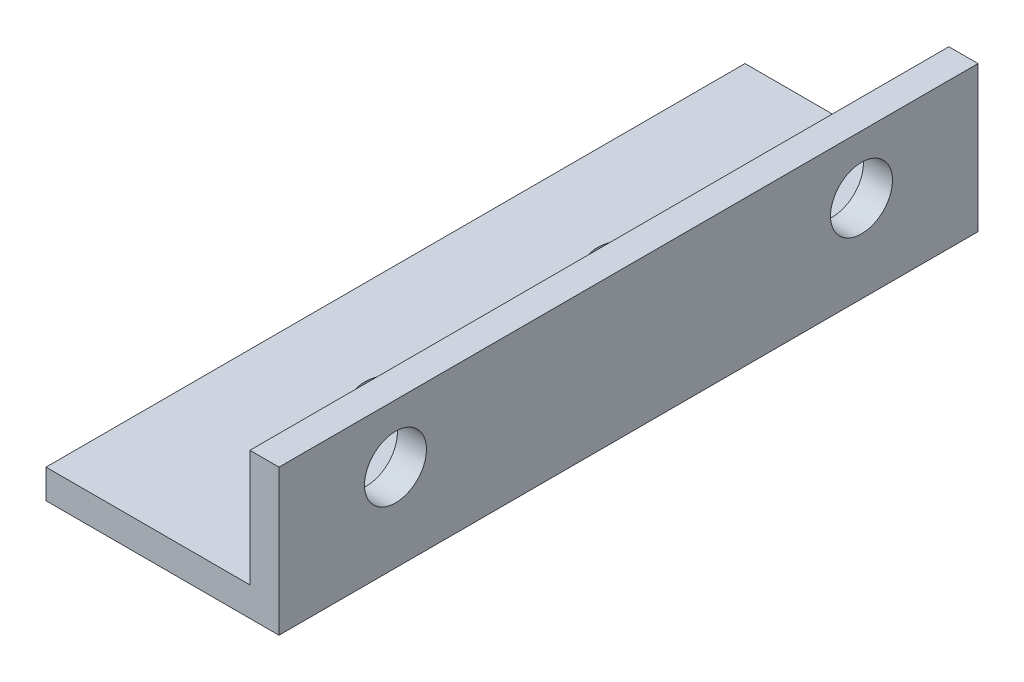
ISO-10303-21;
HEADER;
FILE_DESCRIPTION(('STEP AP214'),'2;1');
FILE_NAME('part.step','',(''),(''),'','','');
FILE_SCHEMA(('AUTOMOTIVE_DESIGN { 1 0 10303 214 1 1 1 1 }'));
ENDSEC;
DATA;
#1=APPLICATION_CONTEXT('core data for automotive mechanical design processes');
#2=APPLICATION_PROTOCOL_DEFINITION('international standard','automotive_design',2000,#1);
#3=PRODUCT_CONTEXT('',#1,'mechanical');
#4=PRODUCT('Part','Part','',(#3));
#5=PRODUCT_RELATED_PRODUCT_CATEGORY('part','',(#4));
#6=PRODUCT_DEFINITION_FORMATION('','',#4);
#7=PRODUCT_DEFINITION_CONTEXT('part definition',#1,'design');
#8=PRODUCT_DEFINITION('design','',#6,#7);
#9=PRODUCT_DEFINITION_SHAPE('','',#8);
#10=(LENGTH_UNIT() NAMED_UNIT(*) SI_UNIT(.MILLI.,.METRE.));
#11=(NAMED_UNIT(*) PLANE_ANGLE_UNIT() SI_UNIT($,.RADIAN.));
#12=(NAMED_UNIT(*) SI_UNIT($,.STERADIAN.) SOLID_ANGLE_UNIT());
#13=UNCERTAINTY_MEASURE_WITH_UNIT(LENGTH_MEASURE(1.E-05),#10,'distance_accuracy_value','');
#14=(GEOMETRIC_REPRESENTATION_CONTEXT(3) GLOBAL_UNCERTAINTY_ASSIGNED_CONTEXT((#13)) GLOBAL_UNIT_ASSIGNED_CONTEXT((#10,
#11,#12)) REPRESENTATION_CONTEXT('',''));
#15=CARTESIAN_POINT('',(0.,0.,0.));
#16=DIRECTION('',(0.,0.,1.));
#17=DIRECTION('',(1.,0.,0.));
#18=AXIS2_PLACEMENT_3D('',#15,#16,#17);
#19=CARTESIAN_POINT('',(-25.4,0.,-76.2));
#20=DIRECTION('',(0.,-1.,0.));
#21=DIRECTION('',(1.,0.,0.));
#22=AXIS2_PLACEMENT_3D('',#19,#20,#21);
#23=PLANE('',#22);
#24=CARTESIAN_POINT('',(-12.7,0.,-50.8));
#25=DIRECTION('',(0.,1.,0.));
#26=DIRECTION('',(0.,0.,1.));
#27=AXIS2_PLACEMENT_3D('',#24,#25,#26);
#28=CIRCLE('',#27,3.3782);
#29=CARTESIAN_POINT('',(-12.7,0.,-47.4218));
#30=VERTEX_POINT('',#29);
#31=EDGE_CURVE('E176',#30,#30,#28,.T.);
#32=ORIENTED_EDGE('',*,*,#31,.T.);
#33=EDGE_LOOP('',(#32));
#34=FACE_BOUND('',#33,.T.);
#35=CARTESIAN_POINT('',(-12.7,0.,-25.4));
#36=DIRECTION('',(0.,1.,0.));
#37=DIRECTION('',(0.,0.,1.));
#38=AXIS2_PLACEMENT_3D('',#35,#36,#37);
#39=CIRCLE('',#38,3.3782);
#40=CARTESIAN_POINT('',(-12.7,0.,-22.0218));
#41=VERTEX_POINT('',#40);
#42=EDGE_CURVE('E121',#41,#41,#39,.T.);
#43=ORIENTED_EDGE('',*,*,#42,.T.);
#44=EDGE_LOOP('',(#43));
#45=FACE_BOUND('',#44,.T.);
#46=DIRECTION('',(1.,0.,0.));
#47=VECTOR('',#46,1.);
#48=CARTESIAN_POINT('',(-25.4,0.,0.));
#49=LINE('',#48,#47);
#50=CARTESIAN_POINT('',(-25.4,0.,0.));
#51=VERTEX_POINT('',#50);
#52=CARTESIAN_POINT('',(0.,0.,0.));
#53=VERTEX_POINT('',#52);
#54=EDGE_CURVE('E117',#51,#53,#49,.T.);
#55=ORIENTED_EDGE('',*,*,#54,.F.);
#56=DIRECTION('',(0.,0.,1.));
#57=VECTOR('',#56,1.);
#58=CARTESIAN_POINT('',(-25.4,0.,-76.2));
#59=LINE('',#58,#57);
#60=CARTESIAN_POINT('',(-25.4,0.,-76.2));
#61=VERTEX_POINT('',#60);
#62=EDGE_CURVE('E11',#61,#51,#59,.T.);
#63=ORIENTED_EDGE('',*,*,#62,.F.);
#64=DIRECTION('',(1.,0.,0.));
#65=VECTOR('',#64,1.);
#66=CARTESIAN_POINT('',(-25.4,0.,-76.2));
#67=LINE('',#66,#65);
#68=CARTESIAN_POINT('',(0.,0.,-76.2));
#69=VERTEX_POINT('',#68);
#70=EDGE_CURVE('E132',#61,#69,#67,.T.);
#71=ORIENTED_EDGE('',*,*,#70,.T.);
#72=DIRECTION('',(0.,0.,1.));
#73=VECTOR('',#72,1.);
#74=CARTESIAN_POINT('',(0.,0.,-76.2));
#75=LINE('',#74,#73);
#76=EDGE_CURVE('E35',#69,#53,#75,.T.);
#77=ORIENTED_EDGE('',*,*,#76,.T.);
#78=EDGE_LOOP('',(#55,#63,#71,#77));
#79=FACE_BOUND('',#78,.T.);
#80=ADVANCED_FACE('F32',(#34,#45,#79),#23,.T.);
#81=CARTESIAN_POINT('',(-25.4,3.175,-76.2));
#82=DIRECTION('',(-1.,0.,0.));
#83=DIRECTION('',(0.,0.,1.));
#84=AXIS2_PLACEMENT_3D('',#81,#82,#83);
#85=PLANE('',#84);
#86=DIRECTION('',(0.,-1.,0.));
#87=VECTOR('',#86,1.);
#88=CARTESIAN_POINT('',(-25.4,3.175,0.));
#89=LINE('',#88,#87);
#90=CARTESIAN_POINT('',(-25.4,3.175,0.));
#91=VERTEX_POINT('',#90);
#92=EDGE_CURVE('E130',#91,#51,#89,.T.);
#93=ORIENTED_EDGE('',*,*,#92,.F.);
#94=DIRECTION('',(0.,0.,1.));
#95=VECTOR('',#94,1.);
#96=CARTESIAN_POINT('',(-25.4,3.175,-76.2));
#97=LINE('',#96,#95);
#98=CARTESIAN_POINT('',(-25.4,3.175,-76.2));
#99=VERTEX_POINT('',#98);
#100=EDGE_CURVE('E41',#99,#91,#97,.T.);
#101=ORIENTED_EDGE('',*,*,#100,.F.);
#102=DIRECTION('',(0.,-1.,0.));
#103=VECTOR('',#102,1.);
#104=CARTESIAN_POINT('',(-25.4,3.175,-76.2));
#105=LINE('',#104,#103);
#106=EDGE_CURVE('E107',#99,#61,#105,.T.);
#107=ORIENTED_EDGE('',*,*,#106,.T.);
#108=ORIENTED_EDGE('',*,*,#62,.T.);
#109=EDGE_LOOP('',(#93,#101,#107,#108));
#110=FACE_BOUND('',#109,.T.);
#111=ADVANCED_FACE('F140',(#110),#85,.T.);
#112=CARTESIAN_POINT('',(-3.175,3.175,-76.2));
#113=DIRECTION('',(0.,1.,0.));
#114=DIRECTION('',(0.,0.,1.));
#115=AXIS2_PLACEMENT_3D('',#112,#113,#114);
#116=PLANE('',#115);
#117=CARTESIAN_POINT('',(-12.7,3.175,-50.8));
#118=DIRECTION('',(0.,1.,0.));
#119=DIRECTION('',(0.,0.,1.));
#120=AXIS2_PLACEMENT_3D('',#117,#118,#119);
#121=CIRCLE('',#120,3.37819999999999);
#122=CARTESIAN_POINT('',(-12.7,3.175,-47.4218));
#123=VERTEX_POINT('',#122);
#124=EDGE_CURVE('E172',#123,#123,#121,.T.);
#125=ORIENTED_EDGE('',*,*,#124,.F.);
#126=EDGE_LOOP('',(#125));
#127=FACE_BOUND('',#126,.T.);
#128=CARTESIAN_POINT('',(-12.7,3.175,-25.4));
#129=DIRECTION('',(0.,1.,0.));
#130=DIRECTION('',(0.,0.,1.));
#131=AXIS2_PLACEMENT_3D('',#128,#129,#130);
#132=CIRCLE('',#131,3.37819999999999);
#133=CARTESIAN_POINT('',(-12.7,3.175,-22.0218));
#134=VERTEX_POINT('',#133);
#135=EDGE_CURVE('E184',#134,#134,#132,.T.);
#136=ORIENTED_EDGE('',*,*,#135,.F.);
#137=EDGE_LOOP('',(#136));
#138=FACE_BOUND('',#137,.T.);
#139=DIRECTION('',(-1.,0.,0.));
#140=VECTOR('',#139,1.);
#141=CARTESIAN_POINT('',(-3.175,3.175,0.));
#142=LINE('',#141,#140);
#143=CARTESIAN_POINT('',(-3.175,3.175,0.));
#144=VERTEX_POINT('',#143);
#145=EDGE_CURVE('E94',#144,#91,#142,.T.);
#146=ORIENTED_EDGE('',*,*,#145,.F.);
#147=DIRECTION('',(0.,0.,1.));
#148=VECTOR('',#147,1.);
#149=CARTESIAN_POINT('',(-3.175,3.175,-76.2));
#150=LINE('',#149,#148);
#151=CARTESIAN_POINT('',(-3.175,3.175,-76.2));
#152=VERTEX_POINT('',#151);
#153=EDGE_CURVE('E89',#152,#144,#150,.T.);
#154=ORIENTED_EDGE('',*,*,#153,.F.);
#155=DIRECTION('',(-1.,0.,0.));
#156=VECTOR('',#155,1.);
#157=CARTESIAN_POINT('',(-3.175,3.175,-76.2));
#158=LINE('',#157,#156);
#159=EDGE_CURVE('E92',#152,#99,#158,.T.);
#160=ORIENTED_EDGE('',*,*,#159,.T.);
#161=ORIENTED_EDGE('',*,*,#100,.T.);
#162=EDGE_LOOP('',(#146,#154,#160,#161));
#163=FACE_BOUND('',#162,.T.);
#164=ADVANCED_FACE('F91',(#127,#138,#163),#116,.T.);
#165=CARTESIAN_POINT('',(-3.175,15.875,-76.2));
#166=DIRECTION('',(-1.,0.,0.));
#167=DIRECTION('',(0.,-1.,0.));
#168=AXIS2_PLACEMENT_3D('',#165,#166,#167);
#169=PLANE('',#168);
#170=CARTESIAN_POINT('',(-3.175,9.525,-63.5));
#171=DIRECTION('',(-1.,0.,0.));
#172=DIRECTION('',(0.,0.,1.));
#173=AXIS2_PLACEMENT_3D('',#170,#171,#172);
#174=CIRCLE('',#173,3.37819999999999);
#175=CARTESIAN_POINT('',(-3.175,9.525,-60.1218));
#176=VERTEX_POINT('',#175);
#177=EDGE_CURVE('E217',#176,#176,#174,.T.);
#178=ORIENTED_EDGE('',*,*,#177,.F.);
#179=EDGE_LOOP('',(#178));
#180=FACE_BOUND('',#179,.T.);
#181=CARTESIAN_POINT('',(-3.175,9.525,-12.7));
#182=DIRECTION('',(-1.,0.,0.));
#183=DIRECTION('',(0.,0.,1.));
#184=AXIS2_PLACEMENT_3D('',#181,#182,#183);
#185=CIRCLE('',#184,3.37819999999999);
#186=CARTESIAN_POINT('',(-3.175,9.525,-9.32180000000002));
#187=VERTEX_POINT('',#186);
#188=EDGE_CURVE('E173',#187,#187,#185,.T.);
#189=ORIENTED_EDGE('',*,*,#188,.F.);
#190=EDGE_LOOP('',(#189));
#191=FACE_BOUND('',#190,.T.);
#192=DIRECTION('',(0.,-1.,0.));
#193=VECTOR('',#192,1.);
#194=CARTESIAN_POINT('',(-3.175,15.875,0.));
#195=LINE('',#194,#193);
#196=CARTESIAN_POINT('',(-3.175,15.875,0.));
#197=VERTEX_POINT('',#196);
#198=EDGE_CURVE('E127',#197,#144,#195,.T.);
#199=ORIENTED_EDGE('',*,*,#198,.F.);
#200=DIRECTION('',(0.,0.,1.));
#201=VECTOR('',#200,1.);
#202=CARTESIAN_POINT('',(-3.175,15.875,-76.2));
#203=LINE('',#202,#201);
#204=CARTESIAN_POINT('',(-3.175,15.875,-76.2));
#205=VERTEX_POINT('',#204);
#206=EDGE_CURVE('E99',#205,#197,#203,.T.);
#207=ORIENTED_EDGE('',*,*,#206,.F.);
#208=DIRECTION('',(0.,-1.,0.));
#209=VECTOR('',#208,1.);
#210=CARTESIAN_POINT('',(-3.175,15.875,-76.2));
#211=LINE('',#210,#209);
#212=EDGE_CURVE('E105',#205,#152,#211,.T.);
#213=ORIENTED_EDGE('',*,*,#212,.T.);
#214=ORIENTED_EDGE('',*,*,#153,.T.);
#215=EDGE_LOOP('',(#199,#207,#213,#214));
#216=FACE_BOUND('',#215,.T.);
#217=ADVANCED_FACE('F109',(#180,#191,#216),#169,.T.);
#218=CARTESIAN_POINT('',(0.,15.875,-76.2));
#219=DIRECTION('',(0.,1.,0.));
#220=DIRECTION('',(0.,0.,1.));
#221=AXIS2_PLACEMENT_3D('',#218,#219,#220);
#222=PLANE('',#221);
#223=DIRECTION('',(-1.,0.,0.));
#224=VECTOR('',#223,1.);
#225=CARTESIAN_POINT('',(0.,15.875,0.));
#226=LINE('',#225,#224);
#227=CARTESIAN_POINT('',(0.,15.875,0.));
#228=VERTEX_POINT('',#227);
#229=EDGE_CURVE('E124',#228,#197,#226,.T.);
#230=ORIENTED_EDGE('',*,*,#229,.F.);
#231=DIRECTION('',(0.,0.,1.));
#232=VECTOR('',#231,1.);
#233=CARTESIAN_POINT('',(0.,15.875,-76.2));
#234=LINE('',#233,#232);
#235=CARTESIAN_POINT('',(0.,15.875,-76.2));
#236=VERTEX_POINT('',#235);
#237=EDGE_CURVE('E135',#236,#228,#234,.T.);
#238=ORIENTED_EDGE('',*,*,#237,.F.);
#239=DIRECTION('',(-1.,0.,0.));
#240=VECTOR('',#239,1.);
#241=CARTESIAN_POINT('',(0.,15.875,-76.2));
#242=LINE('',#241,#240);
#243=EDGE_CURVE('E110',#236,#205,#242,.T.);
#244=ORIENTED_EDGE('',*,*,#243,.T.);
#245=ORIENTED_EDGE('',*,*,#206,.T.);
#246=EDGE_LOOP('',(#230,#238,#244,#245));
#247=FACE_BOUND('',#246,.T.);
#248=ADVANCED_FACE('F155',(#247),#222,.T.);
#249=CARTESIAN_POINT('',(0.,0.,-76.2));
#250=DIRECTION('',(1.,0.,0.));
#251=DIRECTION('',(0.,0.,-1.));
#252=AXIS2_PLACEMENT_3D('',#249,#250,#251);
#253=PLANE('',#252);
#254=CARTESIAN_POINT('',(0.,9.525,-63.5));
#255=DIRECTION('',(-1.,0.,0.));
#256=DIRECTION('',(0.,0.,1.));
#257=AXIS2_PLACEMENT_3D('',#254,#255,#256);
#258=CIRCLE('',#257,3.3782);
#259=CARTESIAN_POINT('',(0.,9.525,-60.1218));
#260=VERTEX_POINT('',#259);
#261=EDGE_CURVE('E167',#260,#260,#258,.T.);
#262=ORIENTED_EDGE('',*,*,#261,.T.);
#263=EDGE_LOOP('',(#262));
#264=FACE_BOUND('',#263,.T.);
#265=CARTESIAN_POINT('',(0.,9.525,-12.7));
#266=DIRECTION('',(-1.,0.,0.));
#267=DIRECTION('',(0.,0.,1.));
#268=AXIS2_PLACEMENT_3D('',#265,#266,#267);
#269=CIRCLE('',#268,3.3782);
#270=CARTESIAN_POINT('',(0.,9.525,-9.3218));
#271=VERTEX_POINT('',#270);
#272=EDGE_CURVE('E170',#271,#271,#269,.T.);
#273=ORIENTED_EDGE('',*,*,#272,.T.);
#274=EDGE_LOOP('',(#273));
#275=FACE_BOUND('',#274,.T.);
#276=DIRECTION('',(0.,1.,0.));
#277=VECTOR('',#276,1.);
#278=CARTESIAN_POINT('',(0.,0.,0.));
#279=LINE('',#278,#277);
#280=EDGE_CURVE('E120',#53,#228,#279,.T.);
#281=ORIENTED_EDGE('',*,*,#280,.F.);
#282=ORIENTED_EDGE('',*,*,#76,.F.);
#283=DIRECTION('',(0.,1.,0.));
#284=VECTOR('',#283,1.);
#285=CARTESIAN_POINT('',(0.,0.,-76.2));
#286=LINE('',#285,#284);
#287=EDGE_CURVE('E112',#69,#236,#286,.T.);
#288=ORIENTED_EDGE('',*,*,#287,.T.);
#289=ORIENTED_EDGE('',*,*,#237,.T.);
#290=EDGE_LOOP('',(#281,#282,#288,#289));
#291=FACE_BOUND('',#290,.T.);
#292=ADVANCED_FACE('F137',(#264,#275,#291),#253,.T.);
#293=CARTESIAN_POINT('',(0.,0.,-76.2));
#294=DIRECTION('',(0.,0.,1.));
#295=DIRECTION('',(1.,0.,0.));
#296=AXIS2_PLACEMENT_3D('',#293,#294,#295);
#297=PLANE('',#296);
#298=ORIENTED_EDGE('',*,*,#70,.F.);
#299=ORIENTED_EDGE('',*,*,#106,.F.);
#300=ORIENTED_EDGE('',*,*,#159,.F.);
#301=ORIENTED_EDGE('',*,*,#212,.F.);
#302=ORIENTED_EDGE('',*,*,#243,.F.);
#303=ORIENTED_EDGE('',*,*,#287,.F.);
#304=EDGE_LOOP('',(#298,#299,#300,#301,#302,#303));
#305=FACE_BOUND('',#304,.T.);
#306=ADVANCED_FACE('F103',(#305),#297,.F.);
#307=CARTESIAN_POINT('',(0.,0.,0.));
#308=DIRECTION('',(0.,0.,1.));
#309=DIRECTION('',(1.,0.,0.));
#310=AXIS2_PLACEMENT_3D('',#307,#308,#309);
#311=PLANE('',#310);
#312=ORIENTED_EDGE('',*,*,#54,.T.);
#313=ORIENTED_EDGE('',*,*,#280,.T.);
#314=ORIENTED_EDGE('',*,*,#229,.T.);
#315=ORIENTED_EDGE('',*,*,#198,.T.);
#316=ORIENTED_EDGE('',*,*,#145,.T.);
#317=ORIENTED_EDGE('',*,*,#92,.T.);
#318=EDGE_LOOP('',(#312,#313,#314,#315,#316,#317));
#319=FACE_BOUND('',#318,.T.);
#320=ADVANCED_FACE('F139',(#319),#311,.T.);
#321=CARTESIAN_POINT('',(-12.7,3.175,-25.4));
#322=DIRECTION('',(0.,1.,0.));
#323=DIRECTION('',(0.,0.,1.));
#324=AXIS2_PLACEMENT_3D('',#321,#322,#323);
#325=CYLINDRICAL_SURFACE('',#324,3.37819999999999);
#326=ORIENTED_EDGE('',*,*,#42,.F.);
#327=EDGE_LOOP('',(#326));
#328=FACE_BOUND('',#327,.T.);
#329=ORIENTED_EDGE('',*,*,#135,.T.);
#330=EDGE_LOOP('',(#329));
#331=FACE_BOUND('',#330,.T.);
#332=ADVANCED_FACE('F192',(#328,#331),#325,.F.);
#333=CARTESIAN_POINT('',(-12.7,3.175,-50.8));
#334=DIRECTION('',(0.,1.,0.));
#335=DIRECTION('',(0.,0.,1.));
#336=AXIS2_PLACEMENT_3D('',#333,#334,#335);
#337=CYLINDRICAL_SURFACE('',#336,3.37819999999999);
#338=ORIENTED_EDGE('',*,*,#31,.F.);
#339=EDGE_LOOP('',(#338));
#340=FACE_BOUND('',#339,.T.);
#341=ORIENTED_EDGE('',*,*,#124,.T.);
#342=EDGE_LOOP('',(#341));
#343=FACE_BOUND('',#342,.T.);
#344=ADVANCED_FACE('F195',(#340,#343),#337,.F.);
#345=CARTESIAN_POINT('',(-3.175,9.525,-12.7));
#346=DIRECTION('',(-1.,0.,0.));
#347=DIRECTION('',(0.,0.,1.));
#348=AXIS2_PLACEMENT_3D('',#345,#346,#347);
#349=CYLINDRICAL_SURFACE('',#348,3.37819999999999);
#350=ORIENTED_EDGE('',*,*,#272,.F.);
#351=EDGE_LOOP('',(#350));
#352=FACE_BOUND('',#351,.T.);
#353=ORIENTED_EDGE('',*,*,#188,.T.);
#354=EDGE_LOOP('',(#353));
#355=FACE_BOUND('',#354,.T.);
#356=ADVANCED_FACE('F203',(#352,#355),#349,.F.);
#357=CARTESIAN_POINT('',(-3.175,9.525,-63.5));
#358=DIRECTION('',(-1.,0.,0.));
#359=DIRECTION('',(0.,0.,1.));
#360=AXIS2_PLACEMENT_3D('',#357,#358,#359);
#361=CYLINDRICAL_SURFACE('',#360,3.37819999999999);
#362=ORIENTED_EDGE('',*,*,#261,.F.);
#363=EDGE_LOOP('',(#362));
#364=FACE_BOUND('',#363,.T.);
#365=ORIENTED_EDGE('',*,*,#177,.T.);
#366=EDGE_LOOP('',(#365));
#367=FACE_BOUND('',#366,.T.);
#368=ADVANCED_FACE('F209',(#364,#367),#361,.F.);
#369=CLOSED_SHELL('',(#80,#111,#164,#217,#248,#292,#306,#320,#332,#344,#356,#368));
#370=MANIFOLD_SOLID_BREP('B2',#369);
#371=ADVANCED_BREP_SHAPE_REPRESENTATION('',(#18,#370),#14);
#372=SHAPE_DEFINITION_REPRESENTATION(#9,#371);
ENDSEC;
END-ISO-10303-21;
